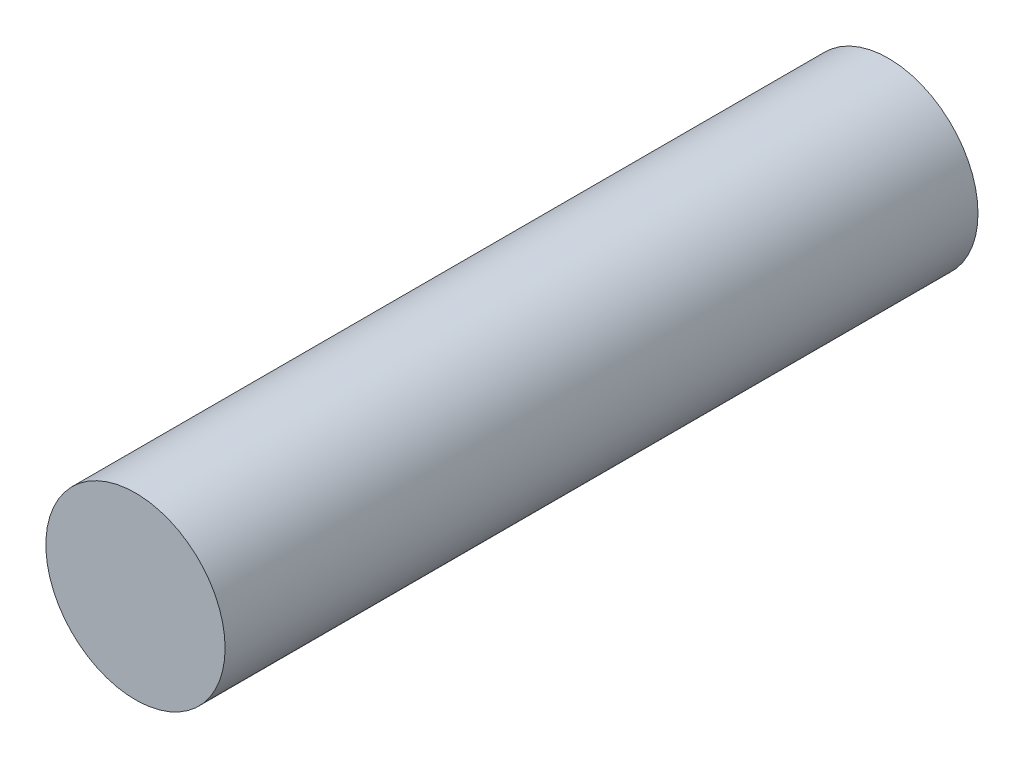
from build123d import *

# Parameters (mm, degrees)
ESQCYLINDRE_R  = 10
CYLINDRE_DEPTH = 84


with BuildPart() as part:
    # EsqCylindre → Cylindre (new body)
    with BuildSketch(Plane.XY):
        Circle(ESQCYLINDRE_R)
    extrude(amount=-CYLINDRE_DEPTH)


solid = part.part
